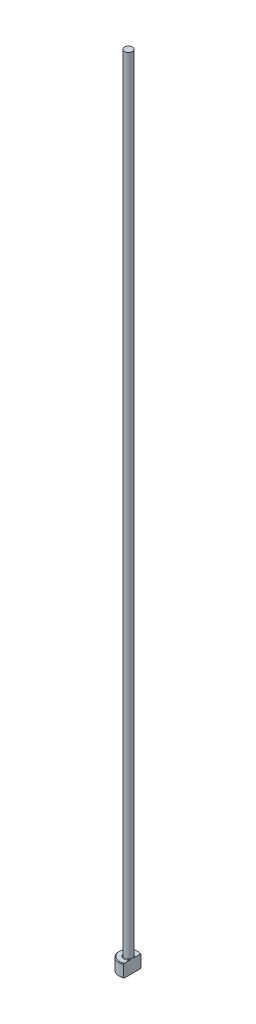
from build123d import *
from build123d.topology import SkipClean

# Parameters (mm, degrees)
CHAMFER1_SIZE    = 0.2
FILLET1_R        = 0.2
KEYED_HEAD_DEPTH = 251.035997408


with BuildPart() as part:
    # Sketch1 → Revolve1 (revolve)
    with BuildSketch(Plane.XY, mode=Mode.PRIVATE) as revolve1_sk:
        Polygon((0, 0), (-3, 0), (-3, 4), (-1.25, 4), (-1.25, 250), (0, 250), align=None)
    revolve(revolve1_sk.sketch.rotate(Axis((0, 259.958771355, 0), (0, -1, 0)), 270), axis=Axis((0, 259.958771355, 0), (0, -1, 0)))

    # Chamfer1
    chamfer1_edges = [part.edges().sort_by_distance(p)[0] for p in [
        (0, 4, -3),
        (0, 0, -3),
    ]]
    chamfer(chamfer1_edges, length=CHAMFER1_SIZE)

    # Fillet1
    fillet1_edges = [part.edges().sort_by_distance(p)[0] for p in [
        (0, 4, -1.25),
    ]]
    fillet(fillet1_edges, radius=FILLET1_R)

    # Sketch2 → KEYED HEAD (cut, through all)
    with SkipClean():  # the faces are left unmerged after this step: merging them gives an invalid solid
        with BuildSketch(Plane(origin=(0, 0, 0), x_dir=(1, 0, 0), z_dir=(0, 1, 0))):
            with BuildLine():
                Line((1.25, -2.727178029), (1.25, 2.727178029))
                ThreePointArc((1.25, 2.727178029), (3, 0), (1.25, -2.727178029))
            make_face()
        extrude(amount=KEYED_HEAD_DEPTH, mode=Mode.SUBTRACT)


solid = part.part
